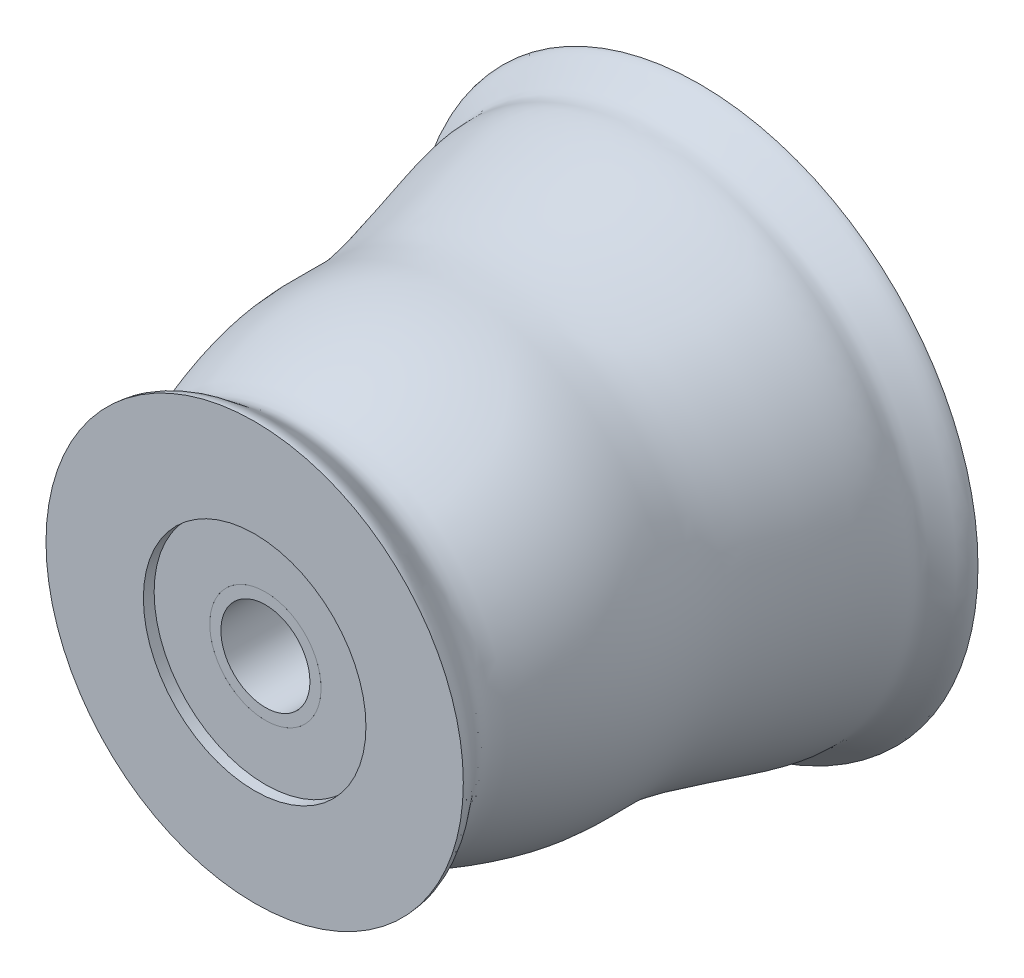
from build123d import *

# Parameters (mm, degrees)
BOSS_EXTRUDE1_REACH = 7.267
SKETCH2_R           = 0.5
SKETCH2_R_2         = 0.4


with BuildPart() as part:
    # Sketch1 → Revolve1 (revolve)
    with BuildSketch(Plane(origin=(0, 0, 0), x_dir=(0, 0, -1), z_dir=(1, 0, 0))):
        with BuildLine():
            Line((-0.2, 0.5), (0, 1))
            Line((0, 1), (0, 2.5))
            add(Edge.make_bspline(
                [(-4, 1.875), (-3.864734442, 1.875), (-3.713224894, 1.600326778), (-2.823217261, 1.960043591), (-2.389721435, 1.993611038), (-1.615168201, 1.958955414), (-0.598255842, 2.329402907), (-0.253593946, 2.276036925), (-0.109261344, 2.5), (0, 2.5)],
                knots=[0, 0, 0, 0, 0.064840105, 0.106377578, 0.38104171, 0.44970298, 0.724329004, 0.782791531, 1, 1, 1, 1], degree=3))
            Line((-4, 1.875), (-4, 1))
            Line((-4, 1), (-3.903379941, 1))
            Line((-3.903379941, 1), (-3.903379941, 0.5))
            Line((-3.903379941, 0.5), (-0.2, 0.5))
        make_face()
    revolve(axis=Axis((0, 0, 0), (0, 0, 1)))


with BuildPart() as body_2:
    # Boss-Extrude1: up to this cone (the profile starts outside it)
    boss_extrude1_end = Plane(origin=(0, 0, 3.90338), z_dir=(0, 0, -1)).offset(3.503381) * Cone(2.5e-06, 10.65905, 4.263619, align=(Align.CENTER, Align.CENTER, Align.MIN), mode=Mode.PRIVATE)
    # Sketch2 → Boss-Extrude1 (new, up to the surface)
    with BuildSketch(Plane.XY.offset(3.903379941), mode=Mode.PRIVATE) as boss_extrude1_sk1:
        Circle(SKETCH2_R)
        Circle(SKETCH2_R_2, mode=Mode.SUBTRACT)
    boss_extrude1_tool1 = extrude(boss_extrude1_sk1.sketch, amount=-BOSS_EXTRUDE1_REACH, mode=Mode.PRIVATE) - boss_extrude1_end
    add(boss_extrude1_tool1.solids().sort_by_distance((-0.485858, 0, 3.90338))[0])


solid = Compound([part.part, body_2.part])
